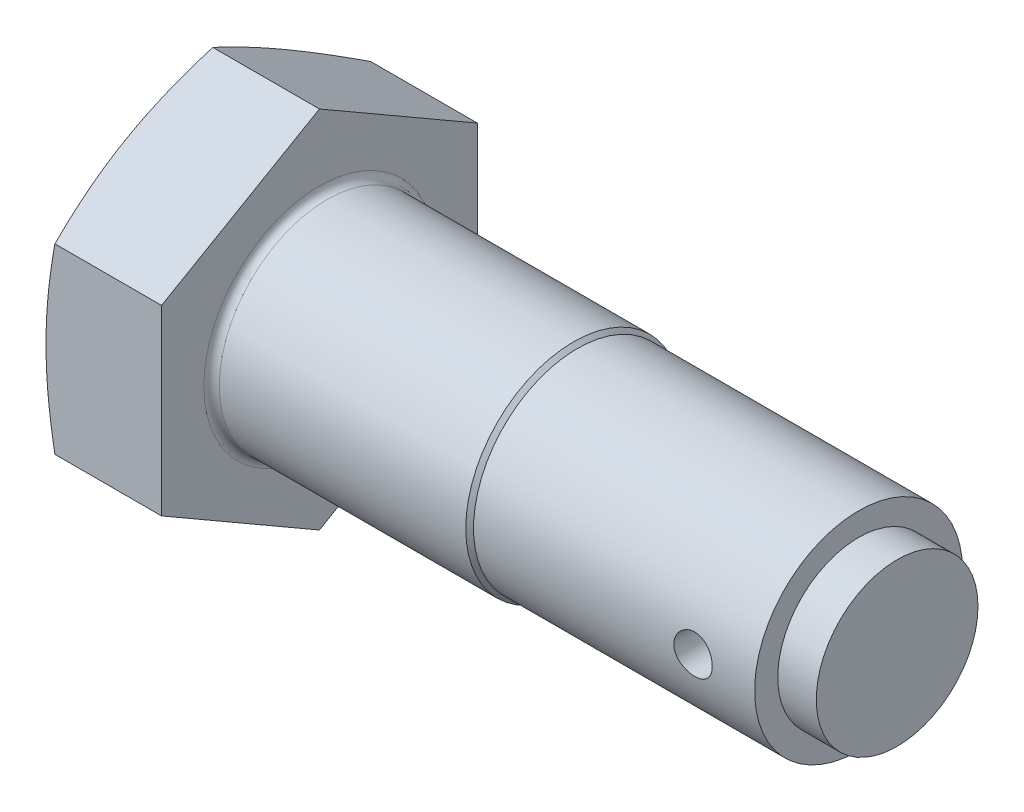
ISO-10303-21;
HEADER;
FILE_DESCRIPTION(('STEP AP214'),'2;1');
FILE_NAME('part.step','',(''),(''),'','','');
FILE_SCHEMA(('AUTOMOTIVE_DESIGN { 1 0 10303 214 1 1 1 1 }'));
ENDSEC;
DATA;
#1=APPLICATION_CONTEXT('core data for automotive mechanical design processes');
#2=APPLICATION_PROTOCOL_DEFINITION('international standard','automotive_design',2000,#1);
#3=PRODUCT_CONTEXT('',#1,'mechanical');
#4=PRODUCT('Part','Part','',(#3));
#5=PRODUCT_RELATED_PRODUCT_CATEGORY('part','',(#4));
#6=PRODUCT_DEFINITION_FORMATION('','',#4);
#7=PRODUCT_DEFINITION_CONTEXT('part definition',#1,'design');
#8=PRODUCT_DEFINITION('design','',#6,#7);
#9=PRODUCT_DEFINITION_SHAPE('','',#8);
#10=(LENGTH_UNIT() NAMED_UNIT(*) SI_UNIT(.MILLI.,.METRE.));
#11=(NAMED_UNIT(*) PLANE_ANGLE_UNIT() SI_UNIT($,.RADIAN.));
#12=(NAMED_UNIT(*) SI_UNIT($,.STERADIAN.) SOLID_ANGLE_UNIT());
#13=UNCERTAINTY_MEASURE_WITH_UNIT(LENGTH_MEASURE(1.E-05),#10,'distance_accuracy_value','');
#14=(GEOMETRIC_REPRESENTATION_CONTEXT(3) GLOBAL_UNCERTAINTY_ASSIGNED_CONTEXT((#13)) GLOBAL_UNIT_ASSIGNED_CONTEXT((#10,
#11,#12)) REPRESENTATION_CONTEXT('',''));
#15=CARTESIAN_POINT('',(0.,0.,0.));
#16=DIRECTION('',(0.,0.,1.));
#17=DIRECTION('',(1.,0.,0.));
#18=AXIS2_PLACEMENT_3D('',#15,#16,#17);
#19=CARTESIAN_POINT('',(15.,-11.8356805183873,20.5));
#20=DIRECTION('',(0.,0.866025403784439,-0.5));
#21=DIRECTION('',(0.,0.5,0.866025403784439));
#22=AXIS2_PLACEMENT_3D('',#19,#20,#21);
#23=PLANE('',#22);
#24=CARTESIAN_POINT('',(1.15432304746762,-23.6714765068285,-0.000199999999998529));
#25=CARTESIAN_POINT('',(1.06511686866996,-23.4263666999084,0.424342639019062));
#26=CARTESIAN_POINT('',(0.979922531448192,-23.1808966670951,0.849509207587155));
#27=CARTESIAN_POINT('',(0.818440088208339,-22.6892027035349,1.70114813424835));
#28=CARTESIAN_POINT('',(0.742152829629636,-22.4429787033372,2.12762061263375));
#29=CARTESIAN_POINT('',(0.527901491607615,-21.7028546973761,3.40955299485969));
#30=CARTESIAN_POINT('',(0.404673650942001,-21.2078415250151,4.26694095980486));
#31=CARTESIAN_POINT('',(0.254912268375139,-20.4659429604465,5.55194696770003));
#32=CARTESIAN_POINT('',(0.210965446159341,-20.2199135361,5.97808243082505));
#33=CARTESIAN_POINT('',(0.135072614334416,-19.7273953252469,6.83114899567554));
#34=CARTESIAN_POINT('',(0.103126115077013,-19.4809065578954,7.25808006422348));
#35=CARTESIAN_POINT('',(0.0517919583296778,-18.9876863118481,8.11236258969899));
#36=CARTESIAN_POINT('',(0.0324000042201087,-18.7409549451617,8.53971385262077));
#37=CARTESIAN_POINT('',(0.00650404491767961,-18.2473226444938,9.39471007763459));
#38=CARTESIAN_POINT('',(0.,-18.0004217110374,9.82235503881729));
#39=CARTESIAN_POINT('',(0.,-17.5066198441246,10.6776449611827));
#40=CARTESIAN_POINT('',(0.00650404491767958,-17.2597189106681,11.1052899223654));
#41=CARTESIAN_POINT('',(0.0324000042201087,-16.7660866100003,11.9602861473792));
#42=CARTESIAN_POINT('',(0.0517919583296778,-16.5193552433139,12.387637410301));
#43=CARTESIAN_POINT('',(0.103126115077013,-16.0261349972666,13.2419199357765));
#44=CARTESIAN_POINT('',(0.135072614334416,-15.779646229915,13.6688510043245));
#45=CARTESIAN_POINT('',(0.21096544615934,-15.2871280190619,14.5219175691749));
#46=CARTESIAN_POINT('',(0.254912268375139,-15.0410985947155,14.9480530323));
#47=CARTESIAN_POINT('',(0.404673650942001,-14.2992000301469,16.2330590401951));
#48=CARTESIAN_POINT('',(0.527901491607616,-13.8041868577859,17.0904470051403));
#49=CARTESIAN_POINT('',(0.742152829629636,-13.0640628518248,18.3723793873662));
#50=CARTESIAN_POINT('',(0.818440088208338,-12.817838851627,18.7988518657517));
#51=CARTESIAN_POINT('',(0.979922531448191,-12.3261448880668,19.6504907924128));
#52=CARTESIAN_POINT('',(1.06511686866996,-12.0806748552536,20.0756573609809));
#53=CARTESIAN_POINT('',(1.15432304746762,-11.8355650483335,20.5002));
#54=B_SPLINE_CURVE_WITH_KNOTS('',3,(#24,#25,#26,#27,#28,#29,#30,#31,#32,#33,#34,#35,#36,#37,#38,
#39,#40,#41,#42,#43,#44,#45,#46,#47,#48,#49,#50,#51,#52,#53),.UNSPECIFIED.,.F.,.F.,(4,2,2,2,2,2,
2,2,2,2,2,2,2,2,4),(0.,1.49476565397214,2.98967340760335,5.98155544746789,7.46349089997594,
8.94536587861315,10.4267334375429,11.9080964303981,13.3894594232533,14.8708269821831,
16.3527019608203,17.8346374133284,20.8265194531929,22.3214272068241,23.8161928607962),.UNSPECIFIED.);
#55=CARTESIAN_POINT('',(1.15428101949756,-23.6713610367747,0.));
#56=VERTEX_POINT('',#55);
#57=CARTESIAN_POINT('',(0.,-17.753520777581,10.25));
#58=VERTEX_POINT('',#57);
#59=EDGE_CURVE('E273',#56,#58,#54,.T.);
#60=ORIENTED_EDGE('',*,*,#59,.F.);
#61=DIRECTION('',(-1.,0.,0.));
#62=VECTOR('',#61,1.);
#63=CARTESIAN_POINT('',(15.,-23.6713610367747,0.));
#64=LINE('',#63,#62);
#65=CARTESIAN_POINT('',(15.,-23.6713610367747,0.));
#66=VERTEX_POINT('',#65);
#67=EDGE_CURVE('E151',#66,#56,#64,.T.);
#68=ORIENTED_EDGE('',*,*,#67,.F.);
#69=DIRECTION('',(0.,-0.5,-0.866025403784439));
#70=VECTOR('',#69,1.);
#71=CARTESIAN_POINT('',(15.,-11.8356805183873,20.5));
#72=LINE('',#71,#70);
#73=CARTESIAN_POINT('',(15.,-11.8356805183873,20.5));
#74=VERTEX_POINT('',#73);
#75=EDGE_CURVE('E283',#74,#66,#72,.T.);
#76=ORIENTED_EDGE('',*,*,#75,.F.);
#77=DIRECTION('',(-1.,0.,0.));
#78=VECTOR('',#77,1.);
#79=CARTESIAN_POINT('',(15.,-11.8356805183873,20.5));
#80=LINE('',#79,#78);
#81=CARTESIAN_POINT('',(1.15428101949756,-11.8356805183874,20.5));
#82=VERTEX_POINT('',#81);
#83=EDGE_CURVE('E138',#74,#82,#80,.T.);
#84=ORIENTED_EDGE('',*,*,#83,.T.);
#85=EDGE_CURVE('E134',#58,#82,#54,.T.);
#86=ORIENTED_EDGE('',*,*,#85,.F.);
#87=EDGE_LOOP('',(#60,#68,#76,#84,#86));
#88=FACE_BOUND('',#87,.T.);
#89=ADVANCED_FACE('F35',(#88),#23,.F.);
#90=CARTESIAN_POINT('',(15.,-23.6713610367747,0.));
#91=DIRECTION('',(0.,0.866025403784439,0.5));
#92=DIRECTION('',(0.,-0.5,0.866025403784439));
#93=AXIS2_PLACEMENT_3D('',#90,#91,#92);
#94=PLANE('',#93);
#95=CARTESIAN_POINT('',(1.15432304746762,-11.8355650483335,-20.5002));
#96=CARTESIAN_POINT('',(1.06511686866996,-12.0806748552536,-20.0756573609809));
#97=CARTESIAN_POINT('',(0.979922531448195,-12.3261448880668,-19.6504907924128));
#98=CARTESIAN_POINT('',(0.818440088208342,-12.817838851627,-18.7988518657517));
#99=CARTESIAN_POINT('',(0.742152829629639,-13.0640628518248,-18.3723793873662));
#100=CARTESIAN_POINT('',(0.527901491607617,-13.8041868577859,-17.0904470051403));
#101=CARTESIAN_POINT('',(0.404673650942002,-14.2992000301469,-16.2330590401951));
#102=CARTESIAN_POINT('',(0.254912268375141,-15.0410985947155,-14.9480530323));
#103=CARTESIAN_POINT('',(0.210965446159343,-15.2871280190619,-14.5219175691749));
#104=CARTESIAN_POINT('',(0.135072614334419,-15.779646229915,-13.6688510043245));
#105=CARTESIAN_POINT('',(0.103126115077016,-16.0261349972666,-13.2419199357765));
#106=CARTESIAN_POINT('',(0.0517919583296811,-16.5193552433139,-12.387637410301));
#107=CARTESIAN_POINT('',(0.0324000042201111,-16.7660866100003,-11.9602861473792));
#108=CARTESIAN_POINT('',(0.00650404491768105,-17.2597189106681,-11.1052899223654));
#109=CARTESIAN_POINT('',(0.,-17.5066198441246,-10.6776449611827));
#110=CARTESIAN_POINT('',(0.,-18.0004217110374,-9.8223550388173));
#111=CARTESIAN_POINT('',(0.00650404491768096,-18.2473226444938,-9.39471007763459));
#112=CARTESIAN_POINT('',(0.0324000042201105,-18.7409549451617,-8.53971385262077));
#113=CARTESIAN_POINT('',(0.0517919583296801,-18.9876863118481,-8.11236258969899));
#114=CARTESIAN_POINT('',(0.103126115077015,-19.4809065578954,-7.25808006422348));
#115=CARTESIAN_POINT('',(0.135072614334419,-19.7273953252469,-6.83114899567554));
#116=CARTESIAN_POINT('',(0.210965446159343,-20.2199135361,-5.97808243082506));
#117=CARTESIAN_POINT('',(0.25491226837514,-20.4659429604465,-5.55194696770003));
#118=CARTESIAN_POINT('',(0.404673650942,-21.2078415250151,-4.26694095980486));
#119=CARTESIAN_POINT('',(0.527901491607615,-21.7028546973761,-3.40955299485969));
#120=CARTESIAN_POINT('',(0.742152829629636,-22.4429787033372,-2.12762061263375));
#121=CARTESIAN_POINT('',(0.818440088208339,-22.6892027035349,-1.70114813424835));
#122=CARTESIAN_POINT('',(0.979922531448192,-23.1808966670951,-0.849509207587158));
#123=CARTESIAN_POINT('',(1.06511686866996,-23.4263666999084,-0.424342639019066));
#124=CARTESIAN_POINT('',(1.15432304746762,-23.6714765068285,0.000199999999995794));
#125=B_SPLINE_CURVE_WITH_KNOTS('',3,(#95,#96,#97,#98,#99,#100,#101,#102,#103,#104,#105,#106,
#107,#108,#109,#110,#111,#112,#113,#114,#115,#116,#117,#118,#119,#120,#121,#122,#123,#124),
.UNSPECIFIED.,.F.,.F.,(4,2,2,2,2,2,2,2,2,2,2,2,2,2,4),(0.,1.49476565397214,2.98967340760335,
5.98155544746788,7.46349089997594,8.94536587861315,10.4267334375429,11.9080964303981,
13.3894594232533,14.8708269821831,16.3527019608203,17.8346374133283,20.8265194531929,
22.3214272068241,23.8161928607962),.UNSPECIFIED.);
#126=CARTESIAN_POINT('',(1.15428101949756,-11.8356805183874,-20.5));
#127=VERTEX_POINT('',#126);
#128=CARTESIAN_POINT('',(0.,-17.753520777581,-10.25));
#129=VERTEX_POINT('',#128);
#130=EDGE_CURVE('E228',#127,#129,#125,.T.);
#131=ORIENTED_EDGE('',*,*,#130,.F.);
#132=DIRECTION('',(-1.,0.,0.));
#133=VECTOR('',#132,1.);
#134=CARTESIAN_POINT('',(15.,-11.8356805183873,-20.5));
#135=LINE('',#134,#133);
#136=CARTESIAN_POINT('',(15.,-11.8356805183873,-20.5));
#137=VERTEX_POINT('',#136);
#138=EDGE_CURVE('E148',#137,#127,#135,.T.);
#139=ORIENTED_EDGE('',*,*,#138,.F.);
#140=DIRECTION('',(0.,0.5,-0.866025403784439));
#141=VECTOR('',#140,1.);
#142=CARTESIAN_POINT('',(15.,-23.6713610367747,0.));
#143=LINE('',#142,#141);
#144=EDGE_CURVE('E280',#66,#137,#143,.T.);
#145=ORIENTED_EDGE('',*,*,#144,.F.);
#146=ORIENTED_EDGE('',*,*,#67,.T.);
#147=EDGE_CURVE('E224',#129,#56,#125,.T.);
#148=ORIENTED_EDGE('',*,*,#147,.F.);
#149=EDGE_LOOP('',(#131,#139,#145,#146,#148));
#150=FACE_BOUND('',#149,.T.);
#151=ADVANCED_FACE('F235',(#150),#94,.F.);
#152=CARTESIAN_POINT('',(15.,-11.8356805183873,-20.5));
#153=DIRECTION('',(0.,0.,1.));
#154=DIRECTION('',(1.,0.,0.));
#155=AXIS2_PLACEMENT_3D('',#152,#153,#154);
#156=PLANE('',#155);
#157=CARTESIAN_POINT('',(6.16802000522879,-31.3367203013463,-20.5));
#158=CARTESIAN_POINT('',(6.02677468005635,-30.8729800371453,-20.5));
#159=CARTESIAN_POINT('',(5.88638353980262,-30.4089797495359,-20.5));
#160=CARTESIAN_POINT('',(5.60750085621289,-29.4804058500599,-20.5));
#161=CARTESIAN_POINT('',(5.46900932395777,-29.0158322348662,-20.5));
#162=CARTESIAN_POINT('',(5.05665312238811,-27.6211108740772,-20.5));
#163=CARTESIAN_POINT('',(4.78592778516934,-26.6900311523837,-20.5));
#164=CARTESIAN_POINT('',(4.25428153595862,-24.8231913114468,-20.5));
#165=CARTESIAN_POINT('',(3.99337985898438,-23.8874257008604,-20.5));
#166=CARTESIAN_POINT('',(3.48441302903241,-22.012414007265,-20.5));
#167=CARTESIAN_POINT('',(3.23634764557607,-21.0731679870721,-20.5));
#168=CARTESIAN_POINT('',(2.75919939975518,-19.2021753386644,-20.5));
#169=CARTESIAN_POINT('',(2.52992020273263,-18.2704790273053,-20.5));
#170=CARTESIAN_POINT('',(2.09088187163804,-16.4024501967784,-20.5));
#171=CARTESIAN_POINT('',(1.88112306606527,-15.466117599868,-20.5));
#172=CARTESIAN_POINT('',(1.48601627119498,-13.5886066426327,-20.5));
#173=CARTESIAN_POINT('',(1.30065995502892,-12.6474300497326,-20.5));
#174=CARTESIAN_POINT('',(0.960002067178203,-10.7596126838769,-20.5));
#175=CARTESIAN_POINT('',(0.804699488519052,-9.81297209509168,-20.5));
#176=CARTESIAN_POINT('',(0.545835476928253,-8.02082218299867,-20.5));
#177=CARTESIAN_POINT('',(0.438425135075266,-7.17587403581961,-20.5));
#178=CARTESIAN_POINT('',(0.256605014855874,-5.48240488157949,-20.5));
#179=CARTESIAN_POINT('',(0.182194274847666,-4.63388397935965,-20.5));
#180=CARTESIAN_POINT('',(0.0699568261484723,-2.93499042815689,-20.5));
#181=CARTESIAN_POINT('',(0.0321042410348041,-2.08461951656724,-20.5));
#182=CARTESIAN_POINT('',(-0.00510042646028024,-0.383026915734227,-20.5));
#183=CARTESIAN_POINT('',(-0.00445278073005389,0.46819476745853,-20.5));
#184=CARTESIAN_POINT('',(0.0354086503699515,2.17403898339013,-20.5));
#185=CARTESIAN_POINT('',(0.0748180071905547,3.02865687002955,-20.5));
#186=CARTESIAN_POINT('',(0.190389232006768,4.73538241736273,-20.5));
#187=CARTESIAN_POINT('',(0.266551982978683,5.58749001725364,-20.5));
#188=CARTESIAN_POINT('',(0.452067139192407,7.28877423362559,-20.5));
#189=CARTESIAN_POINT('',(0.561448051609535,8.13794769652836,-20.5));
#190=CARTESIAN_POINT('',(0.80896274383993,9.83204641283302,-20.5));
#191=CARTESIAN_POINT('',(0.94709667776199,10.6769716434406,-20.5));
#192=CARTESIAN_POINT('',(1.25557044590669,12.4070352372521,-20.5));
#193=CARTESIAN_POINT('',(1.42722732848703,13.2919366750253,-20.5));
#194=CARTESIAN_POINT('',(1.79263434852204,15.0571953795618,-20.5));
#195=CARTESIAN_POINT('',(1.98638615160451,15.9375522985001,-20.5));
#196=CARTESIAN_POINT('',(2.39191462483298,17.6943492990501,-20.5));
#197=CARTESIAN_POINT('',(2.60369652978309,18.5707881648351,-20.5));
#198=CARTESIAN_POINT('',(3.04184013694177,20.319973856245,-20.5));
#199=CARTESIAN_POINT('',(3.26820148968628,21.1927207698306,-20.5));
#200=CARTESIAN_POINT('',(3.73307707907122,22.9361609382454,-20.5));
#201=CARTESIAN_POINT('',(3.97160654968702,23.8068501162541,-20.5));
#202=CARTESIAN_POINT('',(4.45836861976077,25.545508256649,-20.5));
#203=CARTESIAN_POINT('',(4.70660126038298,26.4134772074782,-20.5));
#204=CARTESIAN_POINT('',(5.21099367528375,28.1469457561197,-20.5));
#205=CARTESIAN_POINT('',(5.46715211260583,29.0124457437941,-20.5));
#206=CARTESIAN_POINT('',(5.98605867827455,30.741462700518,-20.5));
#207=CARTESIAN_POINT('',(6.24880679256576,31.6049796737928,-20.5));
#208=CARTESIAN_POINT('',(6.77686389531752,33.320796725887,-20.5));
#209=CARTESIAN_POINT('',(7.04211258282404,34.1731153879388,-20.5));
#210=CARTESIAN_POINT('',(7.57712825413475,35.8763320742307,-20.5));
#211=CARTESIAN_POINT('',(7.84689523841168,36.7272300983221,-20.5));
#212=CARTESIAN_POINT('',(8.39026893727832,38.4278412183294,-20.5));
#213=CARTESIAN_POINT('',(8.6638758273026,39.277554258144,-20.5));
#214=CARTESIAN_POINT('',(9.21435440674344,40.9759223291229,-20.5));
#215=CARTESIAN_POINT('',(9.49122609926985,41.8245773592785,-20.5));
#216=CARTESIAN_POINT('',(10.0467154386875,43.5177478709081,-20.5));
#217=CARTESIAN_POINT('',(10.3253224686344,44.3622668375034,-20.5));
#218=CARTESIAN_POINT('',(10.8849406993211,46.0505080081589,-20.5));
#219=CARTESIAN_POINT('',(11.1659519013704,46.894230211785,-20.5));
#220=CARTESIAN_POINT('',(11.7300385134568,48.5809071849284,-20.5));
#221=CARTESIAN_POINT('',(12.0131137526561,49.4238620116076,-20.5));
#222=CARTESIAN_POINT('',(12.5810959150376,51.1091521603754,-20.5));
#223=CARTESIAN_POINT('',(12.8660028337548,51.9514874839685,-20.5));
#224=CARTESIAN_POINT('',(13.1516986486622,52.7935545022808,-20.5));
#225=B_SPLINE_CURVE_WITH_KNOTS('',3,(#157,#158,#159,#160,#161,#162,#163,#164,#165,#166,#167,
#168,#169,#170,#171,#172,#173,#174,#175,#176,#177,#178,#179,#180,#181,#182,#183,#184,#185,#186,
#187,#188,#189,#190,#191,#192,#193,#194,#195,#196,#197,#198,#199,#200,#201,#202,#203,#204,#205,
#206,#207,#208,#209,#210,#211,#212,#213,#214,#215,#216,#217,#218,#219,#220,#221,#222,#223,#224),
.UNSPECIFIED.,.F.,.F.,(4,2,2,2,2,2,2,2,2,2,2,2,2,2,2,2,2,2,2,2,2,2,2,2,2,2,2,2,2,2,2,2,2,4),(0.,
1.45431873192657,2.90864594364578,5.81751535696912,8.7318119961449,11.6460562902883,
14.5243694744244,17.4027310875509,20.2801079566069,23.1573884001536,25.7120708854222,
28.2666789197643,30.819477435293,33.3722579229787,35.9379848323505,38.5037733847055,
41.0717700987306,43.6397805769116,46.3436259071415,49.0476752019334,51.7525122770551,
54.4572845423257,57.1655304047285,59.8737877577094,62.5815907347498,65.2893879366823,
67.9672895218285,70.6451913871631,73.3232159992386,76.0012431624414,78.6691047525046,
81.3369677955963,84.0046124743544,86.6722506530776),.UNSPECIFIED.);
#226=CARTESIAN_POINT('',(1.15428101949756,11.8356805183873,-20.5));
#227=VERTEX_POINT('',#226);
#228=CARTESIAN_POINT('',(0.,0.,-20.5));
#229=VERTEX_POINT('',#228);
#230=EDGE_CURVE('E302',#227,#229,#225,.F.);
#231=ORIENTED_EDGE('',*,*,#230,.F.);
#232=DIRECTION('',(-1.,0.,0.));
#233=VECTOR('',#232,1.);
#234=CARTESIAN_POINT('',(15.,11.8356805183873,-20.5));
#235=LINE('',#234,#233);
#236=CARTESIAN_POINT('',(15.,11.8356805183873,-20.5));
#237=VERTEX_POINT('',#236);
#238=EDGE_CURVE('E140',#237,#227,#235,.T.);
#239=ORIENTED_EDGE('',*,*,#238,.F.);
#240=DIRECTION('',(0.,1.,0.));
#241=VECTOR('',#240,1.);
#242=CARTESIAN_POINT('',(15.,-11.8356805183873,-20.5));
#243=LINE('',#242,#241);
#244=EDGE_CURVE('E282',#137,#237,#243,.T.);
#245=ORIENTED_EDGE('',*,*,#244,.F.);
#246=ORIENTED_EDGE('',*,*,#138,.T.);
#247=EDGE_CURVE('E229',#229,#127,#225,.F.);
#248=ORIENTED_EDGE('',*,*,#247,.F.);
#249=EDGE_LOOP('',(#231,#239,#245,#246,#248));
#250=FACE_BOUND('',#249,.T.);
#251=ADVANCED_FACE('F238',(#250),#156,.F.);
#252=CARTESIAN_POINT('',(15.,11.8356805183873,-20.5));
#253=DIRECTION('',(0.,-0.866025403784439,0.5));
#254=DIRECTION('',(0.,-0.5,-0.866025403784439));
#255=AXIS2_PLACEMENT_3D('',#252,#253,#254);
#256=PLANE('',#255);
#257=CARTESIAN_POINT('',(1.15432304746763,23.6714765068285,0.000199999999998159));
#258=CARTESIAN_POINT('',(1.06511686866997,23.4263666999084,-0.424342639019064));
#259=CARTESIAN_POINT('',(0.979922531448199,23.1808966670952,-0.849509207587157));
#260=CARTESIAN_POINT('',(0.818440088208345,22.689202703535,-1.70114813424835));
#261=CARTESIAN_POINT('',(0.742152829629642,22.4429787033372,-2.12762061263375));
#262=CARTESIAN_POINT('',(0.527901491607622,21.7028546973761,-3.40955299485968));
#263=CARTESIAN_POINT('',(0.404673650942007,21.2078415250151,-4.26694095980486));
#264=CARTESIAN_POINT('',(0.254912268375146,20.4659429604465,-5.55194696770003));
#265=CARTESIAN_POINT('',(0.210965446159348,20.2199135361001,-5.97808243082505));
#266=CARTESIAN_POINT('',(0.135072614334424,19.727395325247,-6.83114899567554));
#267=CARTESIAN_POINT('',(0.10312611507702,19.4809065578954,-7.25808006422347));
#268=CARTESIAN_POINT('',(0.0517919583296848,18.9876863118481,-8.11236258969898));
#269=CARTESIAN_POINT('',(0.0324000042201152,18.7409549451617,-8.53971385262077));
#270=CARTESIAN_POINT('',(0.00650404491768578,18.2473226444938,-9.39471007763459));
#271=CARTESIAN_POINT('',(0.,18.0004217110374,-9.82235503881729));
#272=CARTESIAN_POINT('',(0.,17.5066198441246,-10.6776449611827));
#273=CARTESIAN_POINT('',(0.00650404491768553,17.2597189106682,-11.1052899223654));
#274=CARTESIAN_POINT('',(0.0324000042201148,16.7660866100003,-11.9602861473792));
#275=CARTESIAN_POINT('',(0.0517919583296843,16.5193552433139,-12.387637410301));
#276=CARTESIAN_POINT('',(0.103126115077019,16.0261349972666,-13.2419199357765));
#277=CARTESIAN_POINT('',(0.135072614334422,15.7796462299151,-13.6688510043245));
#278=CARTESIAN_POINT('',(0.210965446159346,15.287128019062,-14.5219175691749));
#279=CARTESIAN_POINT('',(0.254912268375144,15.0410985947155,-14.9480530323));
#280=CARTESIAN_POINT('',(0.404673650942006,14.2992000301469,-16.2330590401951));
#281=CARTESIAN_POINT('',(0.527901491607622,13.8041868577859,-17.0904470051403));
#282=CARTESIAN_POINT('',(0.742152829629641,13.0640628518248,-18.3723793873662));
#283=CARTESIAN_POINT('',(0.818440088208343,12.8178388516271,-18.7988518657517));
#284=CARTESIAN_POINT('',(0.979922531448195,12.3261448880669,-19.6504907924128));
#285=CARTESIAN_POINT('',(1.06511686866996,12.0806748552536,-20.0756573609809));
#286=CARTESIAN_POINT('',(1.15432304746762,11.8355650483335,-20.5002));
#287=B_SPLINE_CURVE_WITH_KNOTS('',3,(#257,#258,#259,#260,#261,#262,#263,#264,#265,#266,#267,
#268,#269,#270,#271,#272,#273,#274,#275,#276,#277,#278,#279,#280,#281,#282,#283,#284,#285,#286),
.UNSPECIFIED.,.F.,.F.,(4,2,2,2,2,2,2,2,2,2,2,2,2,2,4),(0.,1.49476565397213,2.98967340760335,
5.98155544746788,7.46349089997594,8.94536587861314,10.4267334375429,11.9080964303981,
13.3894594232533,14.8708269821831,16.3527019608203,17.8346374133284,20.8265194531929,
22.3214272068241,23.8161928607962),.UNSPECIFIED.);
#288=CARTESIAN_POINT('',(1.15428101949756,23.6713610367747,0.));
#289=VERTEX_POINT('',#288);
#290=CARTESIAN_POINT('',(0.,17.753520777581,-10.25));
#291=VERTEX_POINT('',#290);
#292=EDGE_CURVE('E218',#289,#291,#287,.T.);
#293=ORIENTED_EDGE('',*,*,#292,.F.);
#294=DIRECTION('',(-1.,0.,0.));
#295=VECTOR('',#294,1.);
#296=CARTESIAN_POINT('',(15.,23.6713610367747,0.));
#297=LINE('',#296,#295);
#298=CARTESIAN_POINT('',(15.,23.6713610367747,0.));
#299=VERTEX_POINT('',#298);
#300=EDGE_CURVE('E137',#299,#289,#297,.T.);
#301=ORIENTED_EDGE('',*,*,#300,.F.);
#302=DIRECTION('',(0.,0.5,0.866025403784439));
#303=VECTOR('',#302,1.);
#304=CARTESIAN_POINT('',(15.,11.8356805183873,-20.5));
#305=LINE('',#304,#303);
#306=EDGE_CURVE('E291',#237,#299,#305,.T.);
#307=ORIENTED_EDGE('',*,*,#306,.F.);
#308=ORIENTED_EDGE('',*,*,#238,.T.);
#309=EDGE_CURVE('E298',#291,#227,#287,.T.);
#310=ORIENTED_EDGE('',*,*,#309,.F.);
#311=EDGE_LOOP('',(#293,#301,#307,#308,#310));
#312=FACE_BOUND('',#311,.T.);
#313=ADVANCED_FACE('F242',(#312),#256,.F.);
#314=CARTESIAN_POINT('',(15.,23.6713610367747,0.));
#315=DIRECTION('',(0.,-0.866025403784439,-0.5));
#316=DIRECTION('',(0.,0.5,-0.866025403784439));
#317=AXIS2_PLACEMENT_3D('',#314,#315,#316);
#318=PLANE('',#317);
#319=CARTESIAN_POINT('',(1.15432304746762,11.8355650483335,20.5002));
#320=CARTESIAN_POINT('',(1.06511686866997,12.0806748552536,20.0756573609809));
#321=CARTESIAN_POINT('',(0.979922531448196,12.3261448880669,19.6504907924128));
#322=CARTESIAN_POINT('',(0.818440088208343,12.8178388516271,18.7988518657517));
#323=CARTESIAN_POINT('',(0.742152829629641,13.0640628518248,18.3723793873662));
#324=CARTESIAN_POINT('',(0.527901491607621,13.8041868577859,17.0904470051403));
#325=CARTESIAN_POINT('',(0.404673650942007,14.2992000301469,16.2330590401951));
#326=CARTESIAN_POINT('',(0.254912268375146,15.0410985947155,14.9480530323));
#327=CARTESIAN_POINT('',(0.210965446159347,15.287128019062,14.5219175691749));
#328=CARTESIAN_POINT('',(0.135072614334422,15.7796462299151,13.6688510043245));
#329=CARTESIAN_POINT('',(0.103126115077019,16.0261349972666,13.2419199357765));
#330=CARTESIAN_POINT('',(0.0517919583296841,16.5193552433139,12.387637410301));
#331=CARTESIAN_POINT('',(0.0324000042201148,16.7660866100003,11.9602861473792));
#332=CARTESIAN_POINT('',(0.0065040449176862,17.2597189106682,11.1052899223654));
#333=CARTESIAN_POINT('',(0.,17.5066198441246,10.6776449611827));
#334=CARTESIAN_POINT('',(0.,18.0004217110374,9.82235503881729));
#335=CARTESIAN_POINT('',(0.0065040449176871,18.2473226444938,9.39471007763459));
#336=CARTESIAN_POINT('',(0.0324000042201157,18.7409549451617,8.53971385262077));
#337=CARTESIAN_POINT('',(0.0517919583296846,18.9876863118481,8.11236258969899));
#338=CARTESIAN_POINT('',(0.103126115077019,19.4809065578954,7.25808006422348));
#339=CARTESIAN_POINT('',(0.135072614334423,19.727395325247,6.83114899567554));
#340=CARTESIAN_POINT('',(0.210965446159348,20.2199135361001,5.97808243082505));
#341=CARTESIAN_POINT('',(0.254912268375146,20.4659429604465,5.55194696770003));
#342=CARTESIAN_POINT('',(0.404673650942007,21.2078415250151,4.26694095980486));
#343=CARTESIAN_POINT('',(0.527901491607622,21.7028546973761,3.40955299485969));
#344=CARTESIAN_POINT('',(0.742152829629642,22.4429787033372,2.12762061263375));
#345=CARTESIAN_POINT('',(0.818440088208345,22.689202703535,1.70114813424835));
#346=CARTESIAN_POINT('',(0.979922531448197,23.1808966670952,0.849509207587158));
#347=CARTESIAN_POINT('',(1.06511686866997,23.4263666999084,0.424342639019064));
#348=CARTESIAN_POINT('',(1.15432304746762,23.6714765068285,-0.000199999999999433));
#349=B_SPLINE_CURVE_WITH_KNOTS('',3,(#319,#320,#321,#322,#323,#324,#325,#326,#327,#328,#329,
#330,#331,#332,#333,#334,#335,#336,#337,#338,#339,#340,#341,#342,#343,#344,#345,#346,#347,#348),
.UNSPECIFIED.,.F.,.F.,(4,2,2,2,2,2,2,2,2,2,2,2,2,2,4),(0.,1.49476565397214,2.98967340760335,
5.98155544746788,7.46349089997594,8.94536587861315,10.4267334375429,11.9080964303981,
13.3894594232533,14.8708269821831,16.3527019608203,17.8346374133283,20.8265194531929,
22.3214272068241,23.8161928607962),.UNSPECIFIED.);
#350=CARTESIAN_POINT('',(1.15428101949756,11.8356805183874,20.5));
#351=VERTEX_POINT('',#350);
#352=CARTESIAN_POINT('',(0.,17.753520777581,10.25));
#353=VERTEX_POINT('',#352);
#354=EDGE_CURVE('E118',#351,#353,#349,.T.);
#355=ORIENTED_EDGE('',*,*,#354,.F.);
#356=DIRECTION('',(-1.,0.,0.));
#357=VECTOR('',#356,1.);
#358=CARTESIAN_POINT('',(15.,11.8356805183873,20.5));
#359=LINE('',#358,#357);
#360=CARTESIAN_POINT('',(15.,11.8356805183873,20.5));
#361=VERTEX_POINT('',#360);
#362=EDGE_CURVE('E131',#361,#351,#359,.T.);
#363=ORIENTED_EDGE('',*,*,#362,.F.);
#364=DIRECTION('',(0.,-0.5,0.866025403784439));
#365=VECTOR('',#364,1.);
#366=CARTESIAN_POINT('',(15.,23.6713610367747,0.));
#367=LINE('',#366,#365);
#368=EDGE_CURVE('E293',#299,#361,#367,.T.);
#369=ORIENTED_EDGE('',*,*,#368,.F.);
#370=ORIENTED_EDGE('',*,*,#300,.T.);
#371=EDGE_CURVE('E133',#353,#289,#349,.T.);
#372=ORIENTED_EDGE('',*,*,#371,.F.);
#373=EDGE_LOOP('',(#355,#363,#369,#370,#372));
#374=FACE_BOUND('',#373,.T.);
#375=ADVANCED_FACE('F129',(#374),#318,.F.);
#376=CARTESIAN_POINT('',(15.,11.8356805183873,20.5));
#377=DIRECTION('',(0.,0.,-1.));
#378=DIRECTION('',(-1.,0.,0.));
#379=AXIS2_PLACEMENT_3D('',#376,#377,#378);
#380=PLANE('',#379);
#381=CARTESIAN_POINT('',(6.16802000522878,-31.3367203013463,20.5));
#382=CARTESIAN_POINT('',(6.02677468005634,-30.8729800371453,20.5));
#383=CARTESIAN_POINT('',(5.88638353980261,-30.4089797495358,20.5));
#384=CARTESIAN_POINT('',(5.60750085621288,-29.4804058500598,20.5));
#385=CARTESIAN_POINT('',(5.46900932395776,-29.0158322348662,20.5));
#386=CARTESIAN_POINT('',(5.05665312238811,-27.6211108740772,20.5));
#387=CARTESIAN_POINT('',(4.78592778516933,-26.6900311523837,20.5));
#388=CARTESIAN_POINT('',(4.25428153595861,-24.8231913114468,20.5));
#389=CARTESIAN_POINT('',(3.99337985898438,-23.8874257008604,20.5));
#390=CARTESIAN_POINT('',(3.4844130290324,-22.012414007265,20.5));
#391=CARTESIAN_POINT('',(3.23634764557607,-21.0731679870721,20.5));
#392=CARTESIAN_POINT('',(2.75919939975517,-19.2021753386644,20.5));
#393=CARTESIAN_POINT('',(2.52992020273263,-18.2704790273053,20.5));
#394=CARTESIAN_POINT('',(2.09088187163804,-16.4024501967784,20.5));
#395=CARTESIAN_POINT('',(1.88112306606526,-15.466117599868,20.5));
#396=CARTESIAN_POINT('',(1.48601627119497,-13.5886066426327,20.5));
#397=CARTESIAN_POINT('',(1.30065995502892,-12.6474300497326,20.5));
#398=CARTESIAN_POINT('',(0.960002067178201,-10.7596126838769,20.5));
#399=CARTESIAN_POINT('',(0.804699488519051,-9.81297209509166,20.5));
#400=CARTESIAN_POINT('',(0.545835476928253,-8.02082218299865,20.5));
#401=CARTESIAN_POINT('',(0.438425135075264,-7.1758740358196,20.5));
#402=CARTESIAN_POINT('',(0.256605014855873,-5.48240488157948,20.5));
#403=CARTESIAN_POINT('',(0.182194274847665,-4.63388397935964,20.5));
#404=CARTESIAN_POINT('',(0.0699568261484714,-2.93499042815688,20.5));
#405=CARTESIAN_POINT('',(0.0321042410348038,-2.08461951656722,20.5));
#406=CARTESIAN_POINT('',(-0.00510042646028,-0.383026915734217,20.5));
#407=CARTESIAN_POINT('',(-0.00445278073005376,0.468194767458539,20.5));
#408=CARTESIAN_POINT('',(0.0354086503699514,2.17403898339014,20.5));
#409=CARTESIAN_POINT('',(0.0748180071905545,3.02865687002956,20.5));
#410=CARTESIAN_POINT('',(0.190389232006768,4.73538241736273,20.5));
#411=CARTESIAN_POINT('',(0.266551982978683,5.58749001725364,20.5));
#412=CARTESIAN_POINT('',(0.452067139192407,7.28877423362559,20.5));
#413=CARTESIAN_POINT('',(0.561448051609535,8.13794769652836,20.5));
#414=CARTESIAN_POINT('',(0.80896274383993,9.83204641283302,20.5));
#415=CARTESIAN_POINT('',(0.947096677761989,10.6769716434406,20.5));
#416=CARTESIAN_POINT('',(1.25557044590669,12.4070352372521,20.5));
#417=CARTESIAN_POINT('',(1.42722732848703,13.2919366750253,20.5));
#418=CARTESIAN_POINT('',(1.79263434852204,15.0571953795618,20.5));
#419=CARTESIAN_POINT('',(1.98638615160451,15.9375522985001,20.5));
#420=CARTESIAN_POINT('',(2.39191462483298,17.6943492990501,20.5));
#421=CARTESIAN_POINT('',(2.60369652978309,18.5707881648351,20.5));
#422=CARTESIAN_POINT('',(3.04184013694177,20.319973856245,20.5));
#423=CARTESIAN_POINT('',(3.26820148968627,21.1927207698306,20.5));
#424=CARTESIAN_POINT('',(3.73307707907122,22.9361609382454,20.5));
#425=CARTESIAN_POINT('',(3.97160654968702,23.8068501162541,20.5));
#426=CARTESIAN_POINT('',(4.45836861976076,25.545508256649,20.5));
#427=CARTESIAN_POINT('',(4.70660126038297,26.4134772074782,20.5));
#428=CARTESIAN_POINT('',(5.21099367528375,28.1469457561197,20.5));
#429=CARTESIAN_POINT('',(5.46715211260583,29.0124457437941,20.5));
#430=CARTESIAN_POINT('',(5.98605867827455,30.7414627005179,20.5));
#431=CARTESIAN_POINT('',(6.24880679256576,31.6049796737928,20.5));
#432=CARTESIAN_POINT('',(6.77686389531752,33.320796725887,20.5));
#433=CARTESIAN_POINT('',(7.04211258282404,34.1731153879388,20.5));
#434=CARTESIAN_POINT('',(7.57712825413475,35.8763320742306,20.5));
#435=CARTESIAN_POINT('',(7.84689523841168,36.7272300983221,20.5));
#436=CARTESIAN_POINT('',(8.39026893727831,38.4278412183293,20.5));
#437=CARTESIAN_POINT('',(8.6638758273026,39.277554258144,20.5));
#438=CARTESIAN_POINT('',(9.21435440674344,40.9759223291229,20.5));
#439=CARTESIAN_POINT('',(9.49122609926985,41.8245773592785,20.5));
#440=CARTESIAN_POINT('',(10.0467154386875,43.5177478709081,20.5));
#441=CARTESIAN_POINT('',(10.3253224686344,44.3622668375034,20.5));
#442=CARTESIAN_POINT('',(10.8849406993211,46.0505080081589,20.5));
#443=CARTESIAN_POINT('',(11.1659519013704,46.894230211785,20.5));
#444=CARTESIAN_POINT('',(11.7300385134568,48.5809071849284,20.5));
#445=CARTESIAN_POINT('',(12.0131137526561,49.4238620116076,20.5));
#446=CARTESIAN_POINT('',(12.5810959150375,51.1091521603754,20.5));
#447=CARTESIAN_POINT('',(12.8660028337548,51.9514874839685,20.5));
#448=CARTESIAN_POINT('',(13.1516986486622,52.7935545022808,20.5));
#449=B_SPLINE_CURVE_WITH_KNOTS('',3,(#381,#382,#383,#384,#385,#386,#387,#388,#389,#390,#391,
#392,#393,#394,#395,#396,#397,#398,#399,#400,#401,#402,#403,#404,#405,#406,#407,#408,#409,#410,
#411,#412,#413,#414,#415,#416,#417,#418,#419,#420,#421,#422,#423,#424,#425,#426,#427,#428,#429,
#430,#431,#432,#433,#434,#435,#436,#437,#438,#439,#440,#441,#442,#443,#444,#445,#446,#447,#448),
.UNSPECIFIED.,.F.,.F.,(4,2,2,2,2,2,2,2,2,2,2,2,2,2,2,2,2,2,2,2,2,2,2,2,2,2,2,2,2,2,2,2,2,4),(0.,
1.45431873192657,2.90864594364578,5.81751535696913,8.7318119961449,11.6460562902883,
14.5243694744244,17.4027310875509,20.2801079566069,23.1573884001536,25.7120708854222,
28.2666789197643,30.8194774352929,33.3722579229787,35.9379848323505,38.5037733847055,
41.0717700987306,43.6397805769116,46.3436259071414,49.0476752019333,51.752512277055,
54.4572845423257,57.1655304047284,59.8737877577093,62.5815907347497,65.2893879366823,
67.9672895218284,70.6451913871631,73.3232159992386,76.0012431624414,78.6691047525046,
81.3369677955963,84.0046124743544,86.6722506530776),.UNSPECIFIED.);
#450=CARTESIAN_POINT('',(0.,0.,20.5));
#451=VERTEX_POINT('',#450);
#452=EDGE_CURVE('E124',#82,#451,#449,.T.);
#453=ORIENTED_EDGE('',*,*,#452,.F.);
#454=ORIENTED_EDGE('',*,*,#83,.F.);
#455=DIRECTION('',(0.,-1.,0.));
#456=VECTOR('',#455,1.);
#457=CARTESIAN_POINT('',(15.,11.8356805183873,20.5));
#458=LINE('',#457,#456);
#459=EDGE_CURVE('E64',#361,#74,#458,.T.);
#460=ORIENTED_EDGE('',*,*,#459,.F.);
#461=ORIENTED_EDGE('',*,*,#362,.T.);
#462=EDGE_CURVE('E115',#451,#351,#449,.T.);
#463=ORIENTED_EDGE('',*,*,#462,.F.);
#464=EDGE_LOOP('',(#453,#454,#460,#461,#463));
#465=FACE_BOUND('',#464,.T.);
#466=ADVANCED_FACE('F136',(#465),#380,.F.);
#467=CARTESIAN_POINT('',(203.183766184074,0.,0.));
#468=DIRECTION('',(-1.,0.,0.));
#469=DIRECTION('',(0.,0.,1.));
#470=AXIS2_PLACEMENT_3D('',#467,#468,#469);
#471=CYLINDRICAL_SURFACE('',#470,13.5);
#472=CARTESIAN_POINT('',(79.5,0.,13.5));
#473=CARTESIAN_POINT('',(79.4999946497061,-0.139151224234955,13.499997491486));
#474=CARTESIAN_POINT('',(79.4883429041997,-0.278372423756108,13.4978263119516));
#475=CARTESIAN_POINT('',(79.4420725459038,-0.552893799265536,13.4893742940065));
#476=CARTESIAN_POINT('',(79.4074343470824,-0.688190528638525,13.4830899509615));
#477=CARTESIAN_POINT('',(79.3162862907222,-0.950852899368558,13.4671148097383));
#478=CARTESIAN_POINT('',(79.259795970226,-1.07822550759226,13.4574270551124));
#479=CARTESIAN_POINT('',(79.1266021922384,-1.32167264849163,13.4357038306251));
#480=CARTESIAN_POINT('',(79.0499004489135,-1.4377481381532,13.4236685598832));
#481=CARTESIAN_POINT('',(78.8775086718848,-1.65667582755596,13.3984220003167));
#482=CARTESIAN_POINT('',(78.7816281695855,-1.75937679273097,13.3851997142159));
#483=CARTESIAN_POINT('',(78.5740103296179,-1.94733202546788,13.3591512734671));
#484=CARTESIAN_POINT('',(78.4622718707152,-2.03258505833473,13.3463251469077));
#485=CARTESIAN_POINT('',(78.2250446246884,-2.18385077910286,13.3224144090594));
#486=CARTESIAN_POINT('',(78.0994565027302,-2.24971012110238,13.3113439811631));
#487=CARTESIAN_POINT('',(77.8387593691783,-2.35933741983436,13.2923527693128));
#488=CARTESIAN_POINT('',(77.7036511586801,-2.40310723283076,13.2844317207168));
#489=CARTESIAN_POINT('',(77.4293655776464,-2.46682866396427,13.2727466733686));
#490=CARTESIAN_POINT('',(77.2902514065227,-2.48704372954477,13.2689367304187));
#491=CARTESIAN_POINT('',(77.0105576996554,-2.50389945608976,13.2657667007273));
#492=CARTESIAN_POINT('',(76.8699782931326,-2.50054217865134,13.2664062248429));
#493=CARTESIAN_POINT('',(76.593250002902,-2.47056225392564,13.2720210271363));
#494=CARTESIAN_POINT('',(76.4570674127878,-2.44423875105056,13.2769405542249));
#495=CARTESIAN_POINT('',(76.1910854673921,-2.36954451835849,13.2904735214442));
#496=CARTESIAN_POINT('',(76.0612863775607,-2.32117287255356,13.2990871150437));
#497=CARTESIAN_POINT('',(75.810878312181,-2.20346165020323,13.3190961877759));
#498=CARTESIAN_POINT('',(75.690327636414,-2.13400088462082,13.3305076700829));
#499=CARTESIAN_POINT('',(75.462480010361,-1.97616890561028,13.3548160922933));
#500=CARTESIAN_POINT('',(75.3551843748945,-1.88779581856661,13.3677131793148));
#501=CARTESIAN_POINT('',(75.1551638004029,-1.69303294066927,13.3937827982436));
#502=CARTESIAN_POINT('',(75.0626880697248,-1.58638718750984,13.4069565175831));
#503=CARTESIAN_POINT('',(74.8969026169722,-1.35896382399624,13.4319128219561));
#504=CARTESIAN_POINT('',(74.8235930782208,-1.23818607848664,13.4436953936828));
#505=CARTESIAN_POINT('',(74.6981859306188,-0.985670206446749,13.4645647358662));
#506=CARTESIAN_POINT('',(74.6461137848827,-0.853919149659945,13.4736482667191));
#507=CARTESIAN_POINT('',(74.5649090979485,-0.583334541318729,13.4880709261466));
#508=CARTESIAN_POINT('',(74.5357741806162,-0.444501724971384,13.4934104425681));
#509=CARTESIAN_POINT('',(74.5016168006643,-0.165839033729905,13.4996903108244));
#510=CARTESIAN_POINT('',(74.496252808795,-0.0260523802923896,13.5006929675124));
#511=CARTESIAN_POINT('',(74.5088740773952,0.252420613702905,13.4983580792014));
#512=CARTESIAN_POINT('',(74.5268582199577,0.391107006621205,13.495020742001));
#513=CARTESIAN_POINT('',(74.5853812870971,0.662362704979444,13.4844196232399));
#514=CARTESIAN_POINT('',(74.6257478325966,0.794970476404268,13.4771858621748));
#515=CARTESIAN_POINT('',(74.7277036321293,1.05153614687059,13.4595996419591));
#516=CARTESIAN_POINT('',(74.7892942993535,1.17549346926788,13.4492469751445));
#517=CARTESIAN_POINT('',(74.9327089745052,1.41270014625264,13.4264159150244));
#518=CARTESIAN_POINT('',(75.0147422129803,1.52582088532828,13.4139159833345));
#519=CARTESIAN_POINT('',(75.1964297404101,1.73681333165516,13.3882335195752));
#520=CARTESIAN_POINT('',(75.2960856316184,1.83468365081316,13.3750509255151));
#521=CARTESIAN_POINT('',(75.5117341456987,2.01369114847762,13.3492828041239));
#522=CARTESIAN_POINT('',(75.6279214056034,2.09459551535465,13.3367072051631));
#523=CARTESIAN_POINT('',(75.872437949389,2.2357389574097,13.3137750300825));
#524=CARTESIAN_POINT('',(76.000766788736,2.2959787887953,13.303418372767));
#525=CARTESIAN_POINT('',(76.2653256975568,2.39375097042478,13.2861742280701));
#526=CARTESIAN_POINT('',(76.4015148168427,2.43139109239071,13.2792703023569));
#527=CARTESIAN_POINT('',(76.6784236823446,2.48322861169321,13.269675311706));
#528=CARTESIAN_POINT('',(76.8191429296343,2.49742858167,13.2669837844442));
#529=CARTESIAN_POINT('',(77.0987864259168,2.50189828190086,13.2661413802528));
#530=CARTESIAN_POINT('',(77.2377047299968,2.49253514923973,13.2679208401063));
#531=CARTESIAN_POINT('',(77.5119509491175,2.45094706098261,13.2756656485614));
#532=CARTESIAN_POINT('',(77.6472788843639,2.41872223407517,13.2816309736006));
#533=CARTESIAN_POINT('',(77.9103118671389,2.33247878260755,13.2970463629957));
#534=CARTESIAN_POINT('',(78.038030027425,2.2784989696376,13.3064902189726));
#535=CARTESIAN_POINT('',(78.2826558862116,2.15031767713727,13.3278031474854));
#536=CARTESIAN_POINT('',(78.399562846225,2.07611481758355,13.3396723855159));
#537=CARTESIAN_POINT('',(78.6210886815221,1.90831342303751,13.3647155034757));
#538=CARTESIAN_POINT('',(78.7255030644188,1.81444734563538,13.3779059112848));
#539=CARTESIAN_POINT('',(78.9172215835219,1.6105427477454,13.4039805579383));
#540=CARTESIAN_POINT('',(79.0045217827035,1.50050051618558,13.4168647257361));
#541=CARTESIAN_POINT('',(79.160245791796,1.26621461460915,13.44100727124));
#542=CARTESIAN_POINT('',(79.2284977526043,1.14185510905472,13.4522504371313));
#543=CARTESIAN_POINT('',(79.3430313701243,0.883267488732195,13.471695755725));
#544=CARTESIAN_POINT('',(79.389333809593,0.749048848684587,13.4799007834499));
#545=CARTESIAN_POINT('',(79.4491763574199,0.512016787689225,13.4906586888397));
#546=CARTESIAN_POINT('',(79.4682028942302,0.410595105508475,13.4941420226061));
#547=CARTESIAN_POINT('',(79.4936165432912,0.206128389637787,13.4988135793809));
#548=CARTESIAN_POINT('',(79.5000039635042,0.103083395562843,13.5000018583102));
#549=CARTESIAN_POINT('',(79.5,0.,13.5));
#550=B_SPLINE_CURVE_WITH_KNOTS('',3,(#472,#473,#474,#475,#476,#477,#478,#479,#480,#481,#482,
#483,#484,#485,#486,#487,#488,#489,#490,#491,#492,#493,#494,#495,#496,#497,#498,#499,#500,#501,
#502,#503,#504,#505,#506,#507,#508,#509,#510,#511,#512,#513,#514,#515,#516,#517,#518,#519,#520,
#521,#522,#523,#524,#525,#526,#527,#528,#529,#530,#531,#532,#533,#534,#535,#536,#537,#538,#539,
#540,#541,#542,#543,#544,#545,#546,#547,#548,#549),.UNSPECIFIED.,.T.,.F.,(4,2,2,2,2,2,2,2,2,2,2,
2,2,2,2,2,2,2,2,2,2,2,2,2,2,2,2,2,2,2,2,2,2,2,2,2,2,2,4),(0.,0.417076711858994,
0.834509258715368,1.25156945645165,1.66859429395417,2.08998704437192,2.51140960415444,
2.93608000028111,3.36071470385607,3.78055306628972,4.20035471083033,4.61476855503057,
5.02919961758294,5.44605879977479,5.86295929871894,6.28626544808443,6.70957564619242,
7.13339190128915,7.55716424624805,7.97482787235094,8.39247150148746,8.80694243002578,
9.22144096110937,9.64036992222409,10.0593369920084,10.4837232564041,10.9080939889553,
11.3304246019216,11.7527088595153,12.1684543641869,12.5841975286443,12.9992022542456,
13.4142353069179,13.8353322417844,14.256525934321,14.6814050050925,15.1058809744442,
15.4148594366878,15.7238303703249),.UNSPECIFIED.);
#551=CARTESIAN_POINT('',(79.5,0.,13.5));
#552=VERTEX_POINT('',#551);
#553=EDGE_CURVE('E39',#552,#552,#550,.T.);
#554=ORIENTED_EDGE('',*,*,#553,.T.);
#555=EDGE_LOOP('',(#554));
#556=FACE_BOUND('',#555,.T.);
#557=CARTESIAN_POINT('',(79.5,0.,-13.5));
#558=CARTESIAN_POINT('',(79.4999946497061,0.139151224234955,-13.499997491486));
#559=CARTESIAN_POINT('',(79.4883429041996,0.278372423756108,-13.4978263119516));
#560=CARTESIAN_POINT('',(79.4420725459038,0.552893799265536,-13.4893742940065));
#561=CARTESIAN_POINT('',(79.4074343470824,0.688190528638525,-13.4830899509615));
#562=CARTESIAN_POINT('',(79.3162862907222,0.95085289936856,-13.4671148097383));
#563=CARTESIAN_POINT('',(79.259795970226,1.07822550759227,-13.4574270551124));
#564=CARTESIAN_POINT('',(79.1266021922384,1.32167264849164,-13.4357038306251));
#565=CARTESIAN_POINT('',(79.0499004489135,1.4377481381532,-13.4236685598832));
#566=CARTESIAN_POINT('',(78.8775086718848,1.65667582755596,-13.3984220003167));
#567=CARTESIAN_POINT('',(78.7816281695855,1.75937679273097,-13.3851997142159));
#568=CARTESIAN_POINT('',(78.5740103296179,1.94733202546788,-13.3591512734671));
#569=CARTESIAN_POINT('',(78.4622718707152,2.03258505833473,-13.3463251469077));
#570=CARTESIAN_POINT('',(78.2250446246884,2.18385077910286,-13.3224144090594));
#571=CARTESIAN_POINT('',(78.0994565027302,2.24971012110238,-13.3113439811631));
#572=CARTESIAN_POINT('',(77.8387593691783,2.35933741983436,-13.2923527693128));
#573=CARTESIAN_POINT('',(77.7036511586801,2.40310723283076,-13.2844317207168));
#574=CARTESIAN_POINT('',(77.4293655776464,2.46682866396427,-13.2727466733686));
#575=CARTESIAN_POINT('',(77.2902514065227,2.48704372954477,-13.2689367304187));
#576=CARTESIAN_POINT('',(77.0105576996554,2.50389945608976,-13.2657667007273));
#577=CARTESIAN_POINT('',(76.8699782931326,2.50054217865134,-13.2664062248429));
#578=CARTESIAN_POINT('',(76.593250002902,2.47056225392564,-13.2720210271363));
#579=CARTESIAN_POINT('',(76.4570674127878,2.44423875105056,-13.2769405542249));
#580=CARTESIAN_POINT('',(76.1910854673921,2.36954451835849,-13.2904735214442));
#581=CARTESIAN_POINT('',(76.0612863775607,2.32117287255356,-13.2990871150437));
#582=CARTESIAN_POINT('',(75.810878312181,2.20346165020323,-13.3190961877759));
#583=CARTESIAN_POINT('',(75.690327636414,2.13400088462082,-13.3305076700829));
#584=CARTESIAN_POINT('',(75.462480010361,1.97616890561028,-13.3548160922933));
#585=CARTESIAN_POINT('',(75.3551843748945,1.88779581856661,-13.3677131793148));
#586=CARTESIAN_POINT('',(75.1551638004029,1.69303294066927,-13.3937827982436));
#587=CARTESIAN_POINT('',(75.0626880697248,1.58638718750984,-13.4069565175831));
#588=CARTESIAN_POINT('',(74.8969026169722,1.35896382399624,-13.4319128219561));
#589=CARTESIAN_POINT('',(74.8235930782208,1.23818607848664,-13.4436953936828));
#590=CARTESIAN_POINT('',(74.6981859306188,0.985670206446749,-13.4645647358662));
#591=CARTESIAN_POINT('',(74.6461137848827,0.853919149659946,-13.4736482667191));
#592=CARTESIAN_POINT('',(74.5649090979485,0.583334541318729,-13.4880709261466));
#593=CARTESIAN_POINT('',(74.5357741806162,0.444501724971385,-13.4934104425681));
#594=CARTESIAN_POINT('',(74.5016168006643,0.165839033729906,-13.4996903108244));
#595=CARTESIAN_POINT('',(74.496252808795,0.0260523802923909,-13.5006929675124));
#596=CARTESIAN_POINT('',(74.5088740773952,-0.252420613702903,-13.4983580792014));
#597=CARTESIAN_POINT('',(74.5268582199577,-0.391107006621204,-13.495020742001));
#598=CARTESIAN_POINT('',(74.5853812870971,-0.662362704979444,-13.4844196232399));
#599=CARTESIAN_POINT('',(74.6257478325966,-0.794970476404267,-13.4771858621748));
#600=CARTESIAN_POINT('',(74.7277036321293,-1.05153614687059,-13.4595996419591));
#601=CARTESIAN_POINT('',(74.7892942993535,-1.17549346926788,-13.4492469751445));
#602=CARTESIAN_POINT('',(74.9327089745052,-1.41270014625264,-13.4264159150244));
#603=CARTESIAN_POINT('',(75.0147422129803,-1.52582088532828,-13.4139159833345));
#604=CARTESIAN_POINT('',(75.1964297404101,-1.73681333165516,-13.3882335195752));
#605=CARTESIAN_POINT('',(75.2960856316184,-1.83468365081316,-13.3750509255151));
#606=CARTESIAN_POINT('',(75.5117341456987,-2.01369114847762,-13.3492828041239));
#607=CARTESIAN_POINT('',(75.6279214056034,-2.09459551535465,-13.3367072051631));
#608=CARTESIAN_POINT('',(75.872437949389,-2.2357389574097,-13.3137750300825));
#609=CARTESIAN_POINT('',(76.000766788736,-2.2959787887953,-13.303418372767));
#610=CARTESIAN_POINT('',(76.2653256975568,-2.39375097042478,-13.2861742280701));
#611=CARTESIAN_POINT('',(76.4015148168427,-2.43139109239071,-13.2792703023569));
#612=CARTESIAN_POINT('',(76.6784236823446,-2.48322861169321,-13.269675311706));
#613=CARTESIAN_POINT('',(76.8191429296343,-2.49742858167,-13.2669837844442));
#614=CARTESIAN_POINT('',(77.0987864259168,-2.50189828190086,-13.2661413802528));
#615=CARTESIAN_POINT('',(77.2377047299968,-2.49253514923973,-13.2679208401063));
#616=CARTESIAN_POINT('',(77.5119509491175,-2.45094706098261,-13.2756656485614));
#617=CARTESIAN_POINT('',(77.6472788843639,-2.41872223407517,-13.2816309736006));
#618=CARTESIAN_POINT('',(77.9103118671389,-2.33247878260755,-13.2970463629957));
#619=CARTESIAN_POINT('',(78.038030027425,-2.2784989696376,-13.3064902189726));
#620=CARTESIAN_POINT('',(78.2826558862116,-2.15031767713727,-13.3278031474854));
#621=CARTESIAN_POINT('',(78.399562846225,-2.07611481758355,-13.3396723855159));
#622=CARTESIAN_POINT('',(78.6210886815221,-1.90831342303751,-13.3647155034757));
#623=CARTESIAN_POINT('',(78.7255030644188,-1.81444734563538,-13.3779059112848));
#624=CARTESIAN_POINT('',(78.9172215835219,-1.6105427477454,-13.4039805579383));
#625=CARTESIAN_POINT('',(79.0045217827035,-1.50050051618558,-13.4168647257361));
#626=CARTESIAN_POINT('',(79.160245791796,-1.26621461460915,-13.44100727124));
#627=CARTESIAN_POINT('',(79.2284977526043,-1.14185510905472,-13.4522504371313));
#628=CARTESIAN_POINT('',(79.3430313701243,-0.883267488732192,-13.471695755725));
#629=CARTESIAN_POINT('',(79.389333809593,-0.749048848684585,-13.4799007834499));
#630=CARTESIAN_POINT('',(79.4491763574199,-0.512016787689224,-13.4906586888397));
#631=CARTESIAN_POINT('',(79.4682028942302,-0.410595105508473,-13.4941420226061));
#632=CARTESIAN_POINT('',(79.4936165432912,-0.206128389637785,-13.4988135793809));
#633=CARTESIAN_POINT('',(79.5000039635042,-0.103083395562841,-13.5000018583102));
#634=CARTESIAN_POINT('',(79.5,0.,-13.5));
#635=B_SPLINE_CURVE_WITH_KNOTS('',3,(#557,#558,#559,#560,#561,#562,#563,#564,#565,#566,#567,
#568,#569,#570,#571,#572,#573,#574,#575,#576,#577,#578,#579,#580,#581,#582,#583,#584,#585,#586,
#587,#588,#589,#590,#591,#592,#593,#594,#595,#596,#597,#598,#599,#600,#601,#602,#603,#604,#605,
#606,#607,#608,#609,#610,#611,#612,#613,#614,#615,#616,#617,#618,#619,#620,#621,#622,#623,#624,
#625,#626,#627,#628,#629,#630,#631,#632,#633,#634),.UNSPECIFIED.,.T.,.F.,(4,2,2,2,2,2,2,2,2,2,2,
2,2,2,2,2,2,2,2,2,2,2,2,2,2,2,2,2,2,2,2,2,2,2,2,2,2,2,4),(0.,0.417076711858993,
0.834509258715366,1.25156945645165,1.66859429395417,2.08998704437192,2.51140960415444,
2.93608000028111,3.36071470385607,3.78055306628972,4.20035471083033,4.61476855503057,
5.02919961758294,5.44605879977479,5.86295929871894,6.28626544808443,6.70957564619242,
7.13339190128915,7.55716424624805,7.97482787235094,8.39247150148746,8.80694243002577,
9.22144096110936,9.64036992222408,10.0593369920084,10.4837232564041,10.9080939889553,
11.3304246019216,11.7527088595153,12.1684543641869,12.5841975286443,12.9992022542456,
13.4142353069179,13.8353322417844,14.256525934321,14.6814050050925,15.1058809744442,
15.4148594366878,15.7238303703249),.UNSPECIFIED.);
#636=CARTESIAN_POINT('',(79.5,0.,-13.5));
#637=VERTEX_POINT('',#636);
#638=EDGE_CURVE('E166',#637,#637,#635,.T.);
#639=ORIENTED_EDGE('',*,*,#638,.T.);
#640=EDGE_LOOP('',(#639));
#641=FACE_BOUND('',#640,.T.);
#642=CARTESIAN_POINT('',(48.5,0.,0.));
#643=DIRECTION('',(1.,0.,0.));
#644=DIRECTION('',(0.,0.,-1.));
#645=AXIS2_PLACEMENT_3D('',#642,#643,#644);
#646=CIRCLE('',#645,13.5);
#647=CARTESIAN_POINT('',(48.5,0.,-13.5));
#648=VERTEX_POINT('',#647);
#649=EDGE_CURVE('E13',#648,#648,#646,.T.);
#650=ORIENTED_EDGE('',*,*,#649,.T.);
#651=EDGE_LOOP('',(#650));
#652=FACE_BOUND('',#651,.T.);
#653=CARTESIAN_POINT('',(85.,0.,0.));
#654=DIRECTION('',(1.,0.,0.));
#655=DIRECTION('',(0.,0.,-1.));
#656=AXIS2_PLACEMENT_3D('',#653,#654,#655);
#657=CIRCLE('',#656,13.5);
#658=CARTESIAN_POINT('',(85.,0.,-13.5));
#659=VERTEX_POINT('',#658);
#660=EDGE_CURVE('E154',#659,#659,#657,.T.);
#661=ORIENTED_EDGE('',*,*,#660,.F.);
#662=EDGE_LOOP('',(#661));
#663=FACE_BOUND('',#662,.T.);
#664=ADVANCED_FACE('F170',(#556,#641,#652,#663),#471,.T.);
#665=CARTESIAN_POINT('',(15.,0.,41.));
#666=DIRECTION('',(-1.,0.,0.));
#667=DIRECTION('',(0.,0.,1.));
#668=AXIS2_PLACEMENT_3D('',#665,#666,#667);
#669=PLANE('',#668);
#670=CARTESIAN_POINT('',(15.,0.,0.));
#671=DIRECTION('',(-1.,0.,0.));
#672=DIRECTION('',(0.,0.,1.));
#673=AXIS2_PLACEMENT_3D('',#670,#671,#672);
#674=CIRCLE('',#673,15.);
#675=CARTESIAN_POINT('',(15.,0.,15.));
#676=VERTEX_POINT('',#675);
#677=EDGE_CURVE('E48',#676,#676,#674,.T.);
#678=ORIENTED_EDGE('',*,*,#677,.T.);
#679=EDGE_LOOP('',(#678));
#680=FACE_BOUND('',#679,.T.);
#681=ORIENTED_EDGE('',*,*,#75,.T.);
#682=ORIENTED_EDGE('',*,*,#144,.T.);
#683=ORIENTED_EDGE('',*,*,#244,.T.);
#684=ORIENTED_EDGE('',*,*,#306,.T.);
#685=ORIENTED_EDGE('',*,*,#368,.T.);
#686=ORIENTED_EDGE('',*,*,#459,.T.);
#687=EDGE_LOOP('',(#681,#682,#683,#684,#685,#686));
#688=FACE_BOUND('',#687,.T.);
#689=ADVANCED_FACE('F252',(#680,#688),#669,.F.);
#690=CARTESIAN_POINT('',(48.,0.,0.));
#691=DIRECTION('',(-1.,0.,0.));
#692=DIRECTION('',(0.,0.,1.));
#693=AXIS2_PLACEMENT_3D('',#690,#691,#692);
#694=CYLINDRICAL_SURFACE('',#693,14.);
#695=CARTESIAN_POINT('',(16.,0.,0.));
#696=DIRECTION('',(-1.,0.,0.));
#697=DIRECTION('',(0.,0.,1.));
#698=AXIS2_PLACEMENT_3D('',#695,#696,#697);
#699=CIRCLE('',#698,14.);
#700=CARTESIAN_POINT('',(16.,0.,14.));
#701=VERTEX_POINT('',#700);
#702=EDGE_CURVE('E162',#701,#701,#699,.F.);
#703=ORIENTED_EDGE('',*,*,#702,.T.);
#704=EDGE_LOOP('',(#703));
#705=FACE_BOUND('',#704,.T.);
#706=CARTESIAN_POINT('',(48.,0.,0.));
#707=DIRECTION('',(1.,0.,0.));
#708=DIRECTION('',(0.,0.,-1.));
#709=AXIS2_PLACEMENT_3D('',#706,#707,#708);
#710=CIRCLE('',#709,14.);
#711=CARTESIAN_POINT('',(48.,0.,-14.));
#712=VERTEX_POINT('',#711);
#713=EDGE_CURVE('E157',#712,#712,#710,.T.);
#714=ORIENTED_EDGE('',*,*,#713,.F.);
#715=EDGE_LOOP('',(#714));
#716=FACE_BOUND('',#715,.T.);
#717=ADVANCED_FACE('F255',(#705,#716),#694,.T.);
#718=CARTESIAN_POINT('',(85.,0.,0.));
#719=DIRECTION('',(1.,0.,0.));
#720=DIRECTION('',(0.,0.,-1.));
#721=AXIS2_PLACEMENT_3D('',#718,#719,#720);
#722=PLANE('',#721);
#723=CARTESIAN_POINT('',(85.,0.,0.));
#724=DIRECTION('',(1.,0.,0.));
#725=DIRECTION('',(0.,0.,-1.));
#726=AXIS2_PLACEMENT_3D('',#723,#724,#725);
#727=CIRCLE('',#726,10.5);
#728=CARTESIAN_POINT('',(85.,0.,-10.5));
#729=VERTEX_POINT('',#728);
#730=EDGE_CURVE('E158',#729,#729,#727,.T.);
#731=ORIENTED_EDGE('',*,*,#730,.F.);
#732=EDGE_LOOP('',(#731));
#733=FACE_BOUND('',#732,.T.);
#734=ORIENTED_EDGE('',*,*,#660,.T.);
#735=EDGE_LOOP('',(#734));
#736=FACE_BOUND('',#735,.T.);
#737=ADVANCED_FACE('F259',(#733,#736),#722,.T.);
#738=CARTESIAN_POINT('',(85.,0.,0.));
#739=DIRECTION('',(1.,0.,0.));
#740=DIRECTION('',(0.,0.,-1.));
#741=AXIS2_PLACEMENT_3D('',#738,#739,#740);
#742=CYLINDRICAL_SURFACE('',#741,10.5);
#743=ORIENTED_EDGE('',*,*,#730,.T.);
#744=EDGE_LOOP('',(#743));
#745=FACE_BOUND('',#744,.T.);
#746=CARTESIAN_POINT('',(90.,0.,0.));
#747=DIRECTION('',(1.,0.,0.));
#748=DIRECTION('',(0.,0.,-1.));
#749=AXIS2_PLACEMENT_3D('',#746,#747,#748);
#750=CIRCLE('',#749,10.5);
#751=CARTESIAN_POINT('',(90.,0.,-10.5));
#752=VERTEX_POINT('',#751);
#753=EDGE_CURVE('E441',#752,#752,#750,.T.);
#754=ORIENTED_EDGE('',*,*,#753,.F.);
#755=EDGE_LOOP('',(#754));
#756=FACE_BOUND('',#755,.T.);
#757=ADVANCED_FACE('F196',(#745,#756),#742,.T.);
#758=CARTESIAN_POINT('',(90.,0.,41.));
#759=DIRECTION('',(-1.,0.,0.));
#760=DIRECTION('',(0.,0.,1.));
#761=AXIS2_PLACEMENT_3D('',#758,#759,#760);
#762=PLANE('',#761);
#763=ORIENTED_EDGE('',*,*,#753,.T.);
#764=EDGE_LOOP('',(#763));
#765=FACE_BOUND('',#764,.T.);
#766=ADVANCED_FACE('F318',(#765),#762,.F.);
#767=CARTESIAN_POINT('',(0.,0.,0.));
#768=DIRECTION('',(1.,0.,0.));
#769=DIRECTION('',(0.,0.,-1.));
#770=AXIS2_PLACEMENT_3D('',#767,#768,#769);
#771=CONICAL_SURFACE('',#770,20.5,1.22173047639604);
#772=ORIENTED_EDGE('',*,*,#85,.T.);
#773=ORIENTED_EDGE('',*,*,#452,.T.);
#774=CARTESIAN_POINT('',(0.,0.,0.));
#775=DIRECTION('',(-1.,0.,0.));
#776=DIRECTION('',(0.,0.,1.));
#777=AXIS2_PLACEMENT_3D('',#774,#775,#776);
#778=CIRCLE('',#777,20.5);
#779=EDGE_CURVE('E56',#58,#451,#778,.T.);
#780=ORIENTED_EDGE('',*,*,#779,.F.);
#781=EDGE_LOOP('',(#772,#773,#780));
#782=FACE_BOUND('',#781,.T.);
#783=ADVANCED_FACE('F313',(#782),#771,.T.);
#784=ORIENTED_EDGE('',*,*,#147,.T.);
#785=ORIENTED_EDGE('',*,*,#59,.T.);
#786=EDGE_CURVE('E160',#129,#58,#778,.T.);
#787=ORIENTED_EDGE('',*,*,#786,.F.);
#788=EDGE_LOOP('',(#784,#785,#787));
#789=FACE_BOUND('',#788,.T.);
#790=ADVANCED_FACE('F309',(#789),#771,.T.);
#791=ORIENTED_EDGE('',*,*,#247,.T.);
#792=ORIENTED_EDGE('',*,*,#130,.T.);
#793=EDGE_CURVE('E306',#229,#129,#778,.T.);
#794=ORIENTED_EDGE('',*,*,#793,.F.);
#795=EDGE_LOOP('',(#791,#792,#794));
#796=FACE_BOUND('',#795,.T.);
#797=ADVANCED_FACE('F194',(#796),#771,.T.);
#798=ORIENTED_EDGE('',*,*,#230,.T.);
#799=EDGE_CURVE('E311',#291,#229,#778,.T.);
#800=ORIENTED_EDGE('',*,*,#799,.F.);
#801=ORIENTED_EDGE('',*,*,#309,.T.);
#802=EDGE_LOOP('',(#798,#800,#801));
#803=FACE_BOUND('',#802,.T.);
#804=ADVANCED_FACE('F189',(#803),#771,.T.);
#805=ORIENTED_EDGE('',*,*,#292,.T.);
#806=EDGE_CURVE('E161',#353,#291,#778,.T.);
#807=ORIENTED_EDGE('',*,*,#806,.F.);
#808=ORIENTED_EDGE('',*,*,#371,.T.);
#809=EDGE_LOOP('',(#805,#807,#808));
#810=FACE_BOUND('',#809,.T.);
#811=ADVANCED_FACE('F193',(#810),#771,.T.);
#812=ORIENTED_EDGE('',*,*,#354,.T.);
#813=CARTESIAN_POINT('',(0.,0.,0.));
#814=DIRECTION('',(-1.,0.,0.));
#815=DIRECTION('',(0.,0.,1.));
#816=AXIS2_PLACEMENT_3D('',#813,#814,#815);
#817=CIRCLE('',#816,20.5);
#818=EDGE_CURVE('E120',#451,#353,#817,.T.);
#819=ORIENTED_EDGE('',*,*,#818,.F.);
#820=ORIENTED_EDGE('',*,*,#462,.T.);
#821=EDGE_LOOP('',(#812,#819,#820));
#822=FACE_BOUND('',#821,.T.);
#823=ADVANCED_FACE('F117',(#822),#771,.T.);
#824=CARTESIAN_POINT('',(0.,0.,41.));
#825=DIRECTION('',(-1.,0.,0.));
#826=DIRECTION('',(0.,0.,1.));
#827=AXIS2_PLACEMENT_3D('',#824,#825,#826);
#828=PLANE('',#827);
#829=ORIENTED_EDGE('',*,*,#779,.T.);
#830=ORIENTED_EDGE('',*,*,#818,.T.);
#831=ORIENTED_EDGE('',*,*,#806,.T.);
#832=ORIENTED_EDGE('',*,*,#799,.T.);
#833=ORIENTED_EDGE('',*,*,#793,.T.);
#834=ORIENTED_EDGE('',*,*,#786,.T.);
#835=EDGE_LOOP('',(#829,#830,#831,#832,#833,#834));
#836=FACE_BOUND('',#835,.T.);
#837=ADVANCED_FACE('F187',(#836),#828,.T.);
#838=CARTESIAN_POINT('',(16.,0.,0.));
#839=DIRECTION('',(-1.,0.,0.));
#840=DIRECTION('',(0.,0.,1.));
#841=AXIS2_PLACEMENT_3D('',#838,#839,#840);
#842=TOROIDAL_SURFACE('',#841,15.,1.);
#843=ORIENTED_EDGE('',*,*,#677,.F.);
#844=EDGE_LOOP('',(#843));
#845=FACE_BOUND('',#844,.T.);
#846=ORIENTED_EDGE('',*,*,#702,.F.);
#847=EDGE_LOOP('',(#846));
#848=FACE_BOUND('',#847,.T.);
#849=ADVANCED_FACE('F183',(#845,#848),#842,.F.);
#850=CARTESIAN_POINT('',(48.5,0.,0.));
#851=DIRECTION('',(-1.,0.,0.));
#852=DIRECTION('',(0.,0.,1.));
#853=AXIS2_PLACEMENT_3D('',#850,#851,#852);
#854=CONICAL_SURFACE('',#853,13.5,0.785398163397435);
#855=ORIENTED_EDGE('',*,*,#713,.T.);
#856=EDGE_LOOP('',(#855));
#857=FACE_BOUND('',#856,.T.);
#858=ORIENTED_EDGE('',*,*,#649,.F.);
#859=EDGE_LOOP('',(#858));
#860=FACE_BOUND('',#859,.T.);
#861=ADVANCED_FACE('F178',(#857,#860),#854,.T.);
#862=CARTESIAN_POINT('',(77.,0.,-20.5));
#863=DIRECTION('',(0.,0.,1.));
#864=DIRECTION('',(1.,0.,0.));
#865=AXIS2_PLACEMENT_3D('',#862,#863,#864);
#866=CYLINDRICAL_SURFACE('',#865,2.50000000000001);
#867=ORIENTED_EDGE('',*,*,#638,.F.);
#868=EDGE_LOOP('',(#867));
#869=FACE_BOUND('',#868,.T.);
#870=ORIENTED_EDGE('',*,*,#553,.F.);
#871=EDGE_LOOP('',(#870));
#872=FACE_BOUND('',#871,.T.);
#873=ADVANCED_FACE('F174',(#869,#872),#866,.F.);
#874=CLOSED_SHELL('',(#89,#151,#251,#313,#375,#466,#664,#689,#717,#737,#757,#766,#783,#790,#797,
#804,#811,#823,#837,#849,#861,#873));
#875=MANIFOLD_SOLID_BREP('B2',#874);
#876=ADVANCED_BREP_SHAPE_REPRESENTATION('',(#18,#875),#14);
#877=SHAPE_DEFINITION_REPRESENTATION(#9,#876);
ENDSEC;
END-ISO-10303-21;
